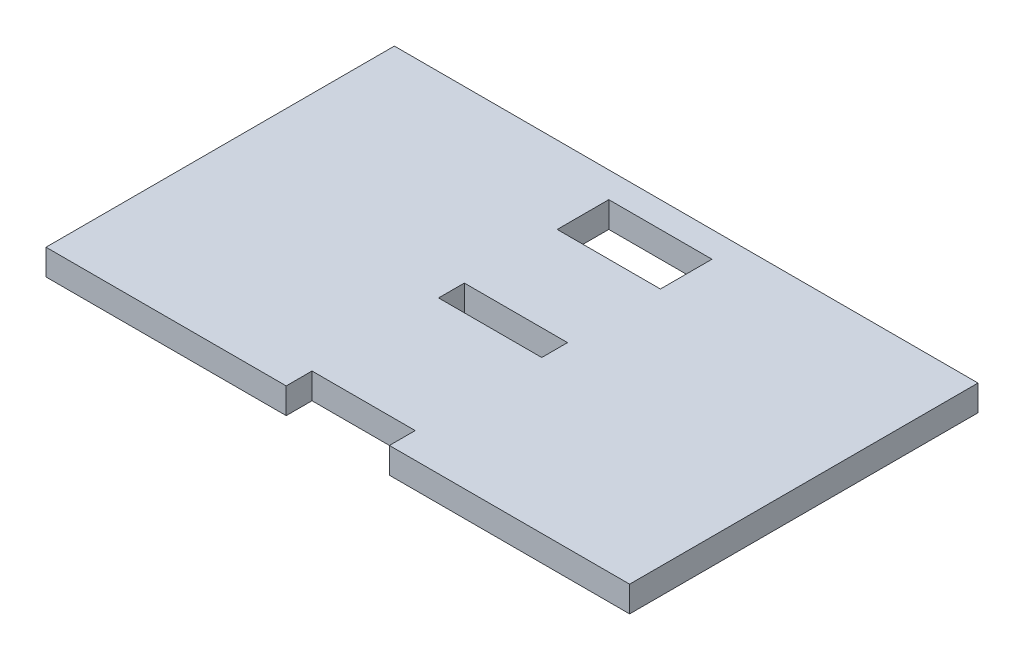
ISO-10303-21;
HEADER;
FILE_DESCRIPTION(('STEP AP214'),'2;1');
FILE_NAME('part.step','',(''),(''),'','','');
FILE_SCHEMA(('AUTOMOTIVE_DESIGN { 1 0 10303 214 1 1 1 1 }'));
ENDSEC;
DATA;
#1=APPLICATION_CONTEXT('core data for automotive mechanical design processes');
#2=APPLICATION_PROTOCOL_DEFINITION('international standard','automotive_design',2000,#1);
#3=PRODUCT_CONTEXT('',#1,'mechanical');
#4=PRODUCT('Part','Part','',(#3));
#5=PRODUCT_RELATED_PRODUCT_CATEGORY('part','',(#4));
#6=PRODUCT_DEFINITION_FORMATION('','',#4);
#7=PRODUCT_DEFINITION_CONTEXT('part definition',#1,'design');
#8=PRODUCT_DEFINITION('design','',#6,#7);
#9=PRODUCT_DEFINITION_SHAPE('','',#8);
#10=(LENGTH_UNIT() NAMED_UNIT(*) SI_UNIT(.MILLI.,.METRE.));
#11=(NAMED_UNIT(*) PLANE_ANGLE_UNIT() SI_UNIT($,.RADIAN.));
#12=(NAMED_UNIT(*) SI_UNIT($,.STERADIAN.) SOLID_ANGLE_UNIT());
#13=UNCERTAINTY_MEASURE_WITH_UNIT(LENGTH_MEASURE(1.E-05),#10,'distance_accuracy_value','');
#14=(GEOMETRIC_REPRESENTATION_CONTEXT(3) GLOBAL_UNCERTAINTY_ASSIGNED_CONTEXT((#13)) GLOBAL_UNIT_ASSIGNED_CONTEXT((#10,
#11,#12)) REPRESENTATION_CONTEXT('',''));
#15=CARTESIAN_POINT('',(0.,0.,0.));
#16=DIRECTION('',(0.,0.,1.));
#17=DIRECTION('',(1.,0.,0.));
#18=AXIS2_PLACEMENT_3D('',#15,#16,#17);
#19=CARTESIAN_POINT('',(0.,5.,0.));
#20=DIRECTION('',(0.,-1.,0.));
#21=DIRECTION('',(0.,0.,-1.));
#22=AXIS2_PLACEMENT_3D('',#19,#20,#21);
#23=PLANE('',#22);
#24=DIRECTION('',(0.,0.,1.));
#25=VECTOR('',#24,1.);
#26=CARTESIAN_POINT('',(46.55945,5.,-109.8613654));
#27=LINE('',#26,#25);
#28=CARTESIAN_POINT('',(46.55945,5.,-109.8613654));
#29=VERTEX_POINT('',#28);
#30=CARTESIAN_POINT('',(46.55945,5.,-99.8613654));
#31=VERTEX_POINT('',#30);
#32=EDGE_CURVE('E188',#29,#31,#27,.T.);
#33=ORIENTED_EDGE('',*,*,#32,.F.);
#34=DIRECTION('',(-1.,0.,0.));
#35=VECTOR('',#34,1.);
#36=CARTESIAN_POINT('',(46.55945,5.,-109.8613654));
#37=LINE('',#36,#35);
#38=CARTESIAN_POINT('',(66.55945,5.,-109.8613654));
#39=VERTEX_POINT('',#38);
#40=EDGE_CURVE('E196',#39,#29,#37,.T.);
#41=ORIENTED_EDGE('',*,*,#40,.F.);
#42=DIRECTION('',(0.,0.,-1.));
#43=VECTOR('',#42,1.);
#44=CARTESIAN_POINT('',(66.55945,5.,-109.8613654));
#45=LINE('',#44,#43);
#46=CARTESIAN_POINT('',(66.55945,5.,-99.8613654));
#47=VERTEX_POINT('',#46);
#48=EDGE_CURVE('E193',#47,#39,#45,.T.);
#49=ORIENTED_EDGE('',*,*,#48,.F.);
#50=DIRECTION('',(1.,0.,0.));
#51=VECTOR('',#50,1.);
#52=CARTESIAN_POINT('',(46.55945,5.,-99.8613654));
#53=LINE('',#52,#51);
#54=EDGE_CURVE('E190',#31,#47,#53,.T.);
#55=ORIENTED_EDGE('',*,*,#54,.F.);
#56=EDGE_LOOP('',(#33,#41,#49,#55));
#57=FACE_BOUND('',#56,.T.);
#58=DIRECTION('',(0.,0.,-1.));
#59=VECTOR('',#58,1.);
#60=CARTESIAN_POINT('',(113.1189,5.,-47.338));
#61=LINE('',#60,#59);
#62=CARTESIAN_POINT('',(113.1189,5.,-47.338));
#63=VERTEX_POINT('',#62);
#64=CARTESIAN_POINT('',(113.1189,5.,-114.8613654));
#65=VERTEX_POINT('',#64);
#66=EDGE_CURVE('E219',#63,#65,#61,.T.);
#67=ORIENTED_EDGE('',*,*,#66,.T.);
#68=DIRECTION('',(-1.,0.,0.));
#69=VECTOR('',#68,1.);
#70=CARTESIAN_POINT('',(0.,5.,-114.8613654));
#71=LINE('',#70,#69);
#72=CARTESIAN_POINT('',(0.,5.,-114.8613654));
#73=VERTEX_POINT('',#72);
#74=EDGE_CURVE('E222',#65,#73,#71,.T.);
#75=ORIENTED_EDGE('',*,*,#74,.T.);
#76=DIRECTION('',(0.,0.,1.));
#77=VECTOR('',#76,1.);
#78=CARTESIAN_POINT('',(0.,5.,-114.8613654));
#79=LINE('',#78,#77);
#80=CARTESIAN_POINT('',(0.,5.,-47.338));
#81=VERTEX_POINT('',#80);
#82=EDGE_CURVE('E225',#73,#81,#79,.T.);
#83=ORIENTED_EDGE('',*,*,#82,.T.);
#84=DIRECTION('',(1.,0.,0.));
#85=VECTOR('',#84,1.);
#86=CARTESIAN_POINT('',(0.,5.,-47.338));
#87=LINE('',#86,#85);
#88=CARTESIAN_POINT('',(46.55945,5.,-47.338));
#89=VERTEX_POINT('',#88);
#90=EDGE_CURVE('E227',#81,#89,#87,.T.);
#91=ORIENTED_EDGE('',*,*,#90,.T.);
#92=DIRECTION('',(0.,0.,-1.));
#93=VECTOR('',#92,1.);
#94=CARTESIAN_POINT('',(46.55945,5.,-47.338));
#95=LINE('',#94,#93);
#96=CARTESIAN_POINT('',(46.55945,5.,-52.338));
#97=VERTEX_POINT('',#96);
#98=EDGE_CURVE('E229',#89,#97,#95,.T.);
#99=ORIENTED_EDGE('',*,*,#98,.T.);
#100=DIRECTION('',(1.,0.,0.));
#101=VECTOR('',#100,1.);
#102=CARTESIAN_POINT('',(46.55945,5.,-52.338));
#103=LINE('',#102,#101);
#104=CARTESIAN_POINT('',(66.55945,5.,-52.338));
#105=VERTEX_POINT('',#104);
#106=EDGE_CURVE('E231',#97,#105,#103,.T.);
#107=ORIENTED_EDGE('',*,*,#106,.T.);
#108=DIRECTION('',(0.,0.,1.));
#109=VECTOR('',#108,1.);
#110=CARTESIAN_POINT('',(66.55945,5.,-47.338));
#111=LINE('',#110,#109);
#112=CARTESIAN_POINT('',(66.55945,5.,-47.338));
#113=VERTEX_POINT('',#112);
#114=EDGE_CURVE('E233',#105,#113,#111,.T.);
#115=ORIENTED_EDGE('',*,*,#114,.T.);
#116=DIRECTION('',(1.,0.,0.));
#117=VECTOR('',#116,1.);
#118=CARTESIAN_POINT('',(66.55945,5.,-47.338));
#119=LINE('',#118,#117);
#120=EDGE_CURVE('E235',#113,#63,#119,.T.);
#121=ORIENTED_EDGE('',*,*,#120,.T.);
#122=EDGE_LOOP('',(#67,#75,#83,#91,#99,#107,#115,#121));
#123=FACE_BOUND('',#122,.T.);
#124=DIRECTION('',(0.,0.,1.));
#125=VECTOR('',#124,1.);
#126=CARTESIAN_POINT('',(46.55945,5.,-76.86424));
#127=LINE('',#126,#125);
#128=CARTESIAN_POINT('',(46.55945,5.,-81.86424));
#129=VERTEX_POINT('',#128);
#130=CARTESIAN_POINT('',(46.55945,5.,-76.86424));
#131=VERTEX_POINT('',#130);
#132=EDGE_CURVE('E152',#129,#131,#127,.T.);
#133=ORIENTED_EDGE('',*,*,#132,.F.);
#134=DIRECTION('',(-1.,0.,0.));
#135=VECTOR('',#134,1.);
#136=CARTESIAN_POINT('',(46.55945,5.,-81.86424));
#137=LINE('',#136,#135);
#138=CARTESIAN_POINT('',(66.55945,5.,-81.86424));
#139=VERTEX_POINT('',#138);
#140=EDGE_CURVE('E174',#139,#129,#137,.T.);
#141=ORIENTED_EDGE('',*,*,#140,.F.);
#142=DIRECTION('',(0.,0.,-1.));
#143=VECTOR('',#142,1.);
#144=CARTESIAN_POINT('',(66.55945,5.,-76.86424));
#145=LINE('',#144,#143);
#146=CARTESIAN_POINT('',(66.55945,5.,-76.86424));
#147=VERTEX_POINT('',#146);
#148=EDGE_CURVE('E172',#147,#139,#145,.T.);
#149=ORIENTED_EDGE('',*,*,#148,.F.);
#150=DIRECTION('',(1.,0.,0.));
#151=VECTOR('',#150,1.);
#152=CARTESIAN_POINT('',(46.55945,5.,-76.86424));
#153=LINE('',#152,#151);
#154=EDGE_CURVE('E160',#131,#147,#153,.T.);
#155=ORIENTED_EDGE('',*,*,#154,.F.);
#156=EDGE_LOOP('',(#133,#141,#149,#155));
#157=FACE_BOUND('',#156,.T.);
#158=ADVANCED_FACE('F39',(#57,#123,#157),#23,.F.);
#159=CARTESIAN_POINT('',(0.,0.,0.));
#160=DIRECTION('',(0.,-1.,0.));
#161=DIRECTION('',(0.,0.,-1.));
#162=AXIS2_PLACEMENT_3D('',#159,#160,#161);
#163=PLANE('',#162);
#164=DIRECTION('',(0.,0.,-1.));
#165=VECTOR('',#164,1.);
#166=CARTESIAN_POINT('',(113.1189,0.,-47.338));
#167=LINE('',#166,#165);
#168=CARTESIAN_POINT('',(113.1189,0.,-47.338));
#169=VERTEX_POINT('',#168);
#170=CARTESIAN_POINT('',(113.1189,0.,-114.8613654));
#171=VERTEX_POINT('',#170);
#172=EDGE_CURVE('E218',#169,#171,#167,.T.);
#173=ORIENTED_EDGE('',*,*,#172,.F.);
#174=DIRECTION('',(1.,0.,0.));
#175=VECTOR('',#174,1.);
#176=CARTESIAN_POINT('',(66.55945,0.,-47.338));
#177=LINE('',#176,#175);
#178=CARTESIAN_POINT('',(66.55945,0.,-47.338));
#179=VERTEX_POINT('',#178);
#180=EDGE_CURVE('E223',#179,#169,#177,.T.);
#181=ORIENTED_EDGE('',*,*,#180,.F.);
#182=DIRECTION('',(0.,0.,1.));
#183=VECTOR('',#182,1.);
#184=CARTESIAN_POINT('',(66.55945,0.,-47.338));
#185=LINE('',#184,#183);
#186=CARTESIAN_POINT('',(66.55945,0.,-52.338));
#187=VERTEX_POINT('',#186);
#188=EDGE_CURVE('E250',#187,#179,#185,.T.);
#189=ORIENTED_EDGE('',*,*,#188,.F.);
#190=DIRECTION('',(1.,0.,0.));
#191=VECTOR('',#190,1.);
#192=CARTESIAN_POINT('',(46.55945,0.,-52.338));
#193=LINE('',#192,#191);
#194=CARTESIAN_POINT('',(46.55945,0.,-52.338));
#195=VERTEX_POINT('',#194);
#196=EDGE_CURVE('E248',#195,#187,#193,.T.);
#197=ORIENTED_EDGE('',*,*,#196,.F.);
#198=DIRECTION('',(0.,0.,-1.));
#199=VECTOR('',#198,1.);
#200=CARTESIAN_POINT('',(46.55945,0.,-47.338));
#201=LINE('',#200,#199);
#202=CARTESIAN_POINT('',(46.55945,0.,-47.338));
#203=VERTEX_POINT('',#202);
#204=EDGE_CURVE('E246',#203,#195,#201,.T.);
#205=ORIENTED_EDGE('',*,*,#204,.F.);
#206=DIRECTION('',(1.,0.,0.));
#207=VECTOR('',#206,1.);
#208=CARTESIAN_POINT('',(0.,0.,-47.338));
#209=LINE('',#208,#207);
#210=CARTESIAN_POINT('',(0.,0.,-47.338));
#211=VERTEX_POINT('',#210);
#212=EDGE_CURVE('E244',#211,#203,#209,.T.);
#213=ORIENTED_EDGE('',*,*,#212,.F.);
#214=DIRECTION('',(0.,0.,1.));
#215=VECTOR('',#214,1.);
#216=CARTESIAN_POINT('',(0.,0.,-114.8613654));
#217=LINE('',#216,#215);
#218=CARTESIAN_POINT('',(0.,0.,-114.8613654));
#219=VERTEX_POINT('',#218);
#220=EDGE_CURVE('E242',#219,#211,#217,.T.);
#221=ORIENTED_EDGE('',*,*,#220,.F.);
#222=DIRECTION('',(-1.,0.,0.));
#223=VECTOR('',#222,1.);
#224=CARTESIAN_POINT('',(0.,0.,-114.8613654));
#225=LINE('',#224,#223);
#226=EDGE_CURVE('E240',#171,#219,#225,.T.);
#227=ORIENTED_EDGE('',*,*,#226,.F.);
#228=EDGE_LOOP('',(#173,#181,#189,#197,#205,#213,#221,#227));
#229=FACE_BOUND('',#228,.T.);
#230=DIRECTION('',(-1.,0.,0.));
#231=VECTOR('',#230,1.);
#232=CARTESIAN_POINT('',(46.55945,0.,-109.8613654));
#233=LINE('',#232,#231);
#234=CARTESIAN_POINT('',(66.55945,0.,-109.8613654));
#235=VERTEX_POINT('',#234);
#236=CARTESIAN_POINT('',(46.55945,0.,-109.8613654));
#237=VERTEX_POINT('',#236);
#238=EDGE_CURVE('E191',#235,#237,#233,.T.);
#239=ORIENTED_EDGE('',*,*,#238,.T.);
#240=DIRECTION('',(0.,0.,1.));
#241=VECTOR('',#240,1.);
#242=CARTESIAN_POINT('',(46.55945,0.,-109.8613654));
#243=LINE('',#242,#241);
#244=CARTESIAN_POINT('',(46.55945,0.,-99.8613654));
#245=VERTEX_POINT('',#244);
#246=EDGE_CURVE('E168',#237,#245,#243,.T.);
#247=ORIENTED_EDGE('',*,*,#246,.T.);
#248=DIRECTION('',(1.,0.,0.));
#249=VECTOR('',#248,1.);
#250=CARTESIAN_POINT('',(46.55945,0.,-99.8613654));
#251=LINE('',#250,#249);
#252=CARTESIAN_POINT('',(66.55945,0.,-99.8613654));
#253=VERTEX_POINT('',#252);
#254=EDGE_CURVE('E201',#245,#253,#251,.T.);
#255=ORIENTED_EDGE('',*,*,#254,.T.);
#256=DIRECTION('',(0.,0.,-1.));
#257=VECTOR('',#256,1.);
#258=CARTESIAN_POINT('',(66.55945,0.,-109.8613654));
#259=LINE('',#258,#257);
#260=EDGE_CURVE('E204',#253,#235,#259,.T.);
#261=ORIENTED_EDGE('',*,*,#260,.T.);
#262=EDGE_LOOP('',(#239,#247,#255,#261));
#263=FACE_BOUND('',#262,.T.);
#264=DIRECTION('',(-1.,0.,0.));
#265=VECTOR('',#264,1.);
#266=CARTESIAN_POINT('',(46.55945,0.,-81.86424));
#267=LINE('',#266,#265);
#268=CARTESIAN_POINT('',(66.55945,0.,-81.86424));
#269=VERTEX_POINT('',#268);
#270=CARTESIAN_POINT('',(46.55945,0.,-81.86424));
#271=VERTEX_POINT('',#270);
#272=EDGE_CURVE('E161',#269,#271,#267,.T.);
#273=ORIENTED_EDGE('',*,*,#272,.T.);
#274=DIRECTION('',(0.,0.,1.));
#275=VECTOR('',#274,1.);
#276=CARTESIAN_POINT('',(46.55945,0.,-76.86424));
#277=LINE('',#276,#275);
#278=CARTESIAN_POINT('',(46.55945,0.,-76.86424));
#279=VERTEX_POINT('',#278);
#280=EDGE_CURVE('E62',#271,#279,#277,.T.);
#281=ORIENTED_EDGE('',*,*,#280,.T.);
#282=DIRECTION('',(1.,0.,0.));
#283=VECTOR('',#282,1.);
#284=CARTESIAN_POINT('',(46.55945,0.,-76.86424));
#285=LINE('',#284,#283);
#286=CARTESIAN_POINT('',(66.55945,0.,-76.86424));
#287=VERTEX_POINT('',#286);
#288=EDGE_CURVE('E167',#279,#287,#285,.T.);
#289=ORIENTED_EDGE('',*,*,#288,.T.);
#290=DIRECTION('',(0.,0.,-1.));
#291=VECTOR('',#290,1.);
#292=CARTESIAN_POINT('',(66.55945,0.,-76.86424));
#293=LINE('',#292,#291);
#294=EDGE_CURVE('E180',#287,#269,#293,.T.);
#295=ORIENTED_EDGE('',*,*,#294,.T.);
#296=EDGE_LOOP('',(#273,#281,#289,#295));
#297=FACE_BOUND('',#296,.T.);
#298=ADVANCED_FACE('F280',(#229,#263,#297),#163,.T.);
#299=CARTESIAN_POINT('',(113.1189,5.,-47.338));
#300=DIRECTION('',(-1.,0.,0.));
#301=DIRECTION('',(0.,0.,1.));
#302=AXIS2_PLACEMENT_3D('',#299,#300,#301);
#303=PLANE('',#302);
#304=ORIENTED_EDGE('',*,*,#172,.T.);
#305=DIRECTION('',(0.,-1.,0.));
#306=VECTOR('',#305,1.);
#307=CARTESIAN_POINT('',(113.1189,5.,-114.8613654));
#308=LINE('',#307,#306);
#309=EDGE_CURVE('E11',#65,#171,#308,.T.);
#310=ORIENTED_EDGE('',*,*,#309,.F.);
#311=ORIENTED_EDGE('',*,*,#66,.F.);
#312=DIRECTION('',(0.,-1.,0.));
#313=VECTOR('',#312,1.);
#314=CARTESIAN_POINT('',(113.1189,5.,-47.338));
#315=LINE('',#314,#313);
#316=EDGE_CURVE('E237',#63,#169,#315,.T.);
#317=ORIENTED_EDGE('',*,*,#316,.T.);
#318=EDGE_LOOP('',(#304,#310,#311,#317));
#319=FACE_BOUND('',#318,.T.);
#320=ADVANCED_FACE('F41',(#319),#303,.F.);
#321=CARTESIAN_POINT('',(0.,5.,-114.8613654));
#322=DIRECTION('',(0.,0.,1.));
#323=DIRECTION('',(1.,0.,0.));
#324=AXIS2_PLACEMENT_3D('',#321,#322,#323);
#325=PLANE('',#324);
#326=ORIENTED_EDGE('',*,*,#226,.T.);
#327=DIRECTION('',(0.,-1.,0.));
#328=VECTOR('',#327,1.);
#329=CARTESIAN_POINT('',(0.,5.,-114.8613654));
#330=LINE('',#329,#328);
#331=EDGE_CURVE('E47',#73,#219,#330,.T.);
#332=ORIENTED_EDGE('',*,*,#331,.F.);
#333=ORIENTED_EDGE('',*,*,#74,.F.);
#334=ORIENTED_EDGE('',*,*,#309,.T.);
#335=EDGE_LOOP('',(#326,#332,#333,#334));
#336=FACE_BOUND('',#335,.T.);
#337=ADVANCED_FACE('F297',(#336),#325,.F.);
#338=CARTESIAN_POINT('',(0.,5.,-114.8613654));
#339=DIRECTION('',(1.,0.,0.));
#340=DIRECTION('',(0.,0.,-1.));
#341=AXIS2_PLACEMENT_3D('',#338,#339,#340);
#342=PLANE('',#341);
#343=ORIENTED_EDGE('',*,*,#220,.T.);
#344=DIRECTION('',(0.,-1.,0.));
#345=VECTOR('',#344,1.);
#346=CARTESIAN_POINT('',(0.,5.,-47.338));
#347=LINE('',#346,#345);
#348=EDGE_CURVE('E267',#81,#211,#347,.T.);
#349=ORIENTED_EDGE('',*,*,#348,.F.);
#350=ORIENTED_EDGE('',*,*,#82,.F.);
#351=ORIENTED_EDGE('',*,*,#331,.T.);
#352=EDGE_LOOP('',(#343,#349,#350,#351));
#353=FACE_BOUND('',#352,.T.);
#354=ADVANCED_FACE('F274',(#353),#342,.F.);
#355=CARTESIAN_POINT('',(0.,5.,-47.338));
#356=DIRECTION('',(0.,0.,-1.));
#357=DIRECTION('',(-1.,0.,0.));
#358=AXIS2_PLACEMENT_3D('',#355,#356,#357);
#359=PLANE('',#358);
#360=ORIENTED_EDGE('',*,*,#212,.T.);
#361=DIRECTION('',(0.,-1.,0.));
#362=VECTOR('',#361,1.);
#363=CARTESIAN_POINT('',(46.55945,5.,-47.338));
#364=LINE('',#363,#362);
#365=EDGE_CURVE('E264',#89,#203,#364,.T.);
#366=ORIENTED_EDGE('',*,*,#365,.F.);
#367=ORIENTED_EDGE('',*,*,#90,.F.);
#368=ORIENTED_EDGE('',*,*,#348,.T.);
#369=EDGE_LOOP('',(#360,#366,#367,#368));
#370=FACE_BOUND('',#369,.T.);
#371=ADVANCED_FACE('F286',(#370),#359,.F.);
#372=CARTESIAN_POINT('',(46.55945,5.,-47.338));
#373=DIRECTION('',(-1.,0.,0.));
#374=DIRECTION('',(0.,0.,1.));
#375=AXIS2_PLACEMENT_3D('',#372,#373,#374);
#376=PLANE('',#375);
#377=ORIENTED_EDGE('',*,*,#204,.T.);
#378=DIRECTION('',(0.,-1.,0.));
#379=VECTOR('',#378,1.);
#380=CARTESIAN_POINT('',(46.55945,5.,-52.338));
#381=LINE('',#380,#379);
#382=EDGE_CURVE('E261',#97,#195,#381,.T.);
#383=ORIENTED_EDGE('',*,*,#382,.F.);
#384=ORIENTED_EDGE('',*,*,#98,.F.);
#385=ORIENTED_EDGE('',*,*,#365,.T.);
#386=EDGE_LOOP('',(#377,#383,#384,#385));
#387=FACE_BOUND('',#386,.T.);
#388=ADVANCED_FACE('F290',(#387),#376,.F.);
#389=CARTESIAN_POINT('',(46.55945,5.,-52.338));
#390=DIRECTION('',(0.,0.,-1.));
#391=DIRECTION('',(-1.,0.,0.));
#392=AXIS2_PLACEMENT_3D('',#389,#390,#391);
#393=PLANE('',#392);
#394=ORIENTED_EDGE('',*,*,#196,.T.);
#395=DIRECTION('',(0.,-1.,0.));
#396=VECTOR('',#395,1.);
#397=CARTESIAN_POINT('',(66.55945,5.,-52.338));
#398=LINE('',#397,#396);
#399=EDGE_CURVE('E258',#105,#187,#398,.T.);
#400=ORIENTED_EDGE('',*,*,#399,.F.);
#401=ORIENTED_EDGE('',*,*,#106,.F.);
#402=ORIENTED_EDGE('',*,*,#382,.T.);
#403=EDGE_LOOP('',(#394,#400,#401,#402));
#404=FACE_BOUND('',#403,.T.);
#405=ADVANCED_FACE('F310',(#404),#393,.F.);
#406=CARTESIAN_POINT('',(66.55945,5.,-47.338));
#407=DIRECTION('',(1.,0.,0.));
#408=DIRECTION('',(0.,0.,-1.));
#409=AXIS2_PLACEMENT_3D('',#406,#407,#408);
#410=PLANE('',#409);
#411=ORIENTED_EDGE('',*,*,#188,.T.);
#412=DIRECTION('',(0.,-1.,0.));
#413=VECTOR('',#412,1.);
#414=CARTESIAN_POINT('',(66.55945,5.,-47.338));
#415=LINE('',#414,#413);
#416=EDGE_CURVE('E255',#113,#179,#415,.T.);
#417=ORIENTED_EDGE('',*,*,#416,.F.);
#418=ORIENTED_EDGE('',*,*,#114,.F.);
#419=ORIENTED_EDGE('',*,*,#399,.T.);
#420=EDGE_LOOP('',(#411,#417,#418,#419));
#421=FACE_BOUND('',#420,.T.);
#422=ADVANCED_FACE('F308',(#421),#410,.F.);
#423=CARTESIAN_POINT('',(66.55945,5.,-47.338));
#424=DIRECTION('',(0.,0.,-1.));
#425=DIRECTION('',(-1.,0.,0.));
#426=AXIS2_PLACEMENT_3D('',#423,#424,#425);
#427=PLANE('',#426);
#428=ORIENTED_EDGE('',*,*,#180,.T.);
#429=ORIENTED_EDGE('',*,*,#316,.F.);
#430=ORIENTED_EDGE('',*,*,#120,.F.);
#431=ORIENTED_EDGE('',*,*,#416,.T.);
#432=EDGE_LOOP('',(#428,#429,#430,#431));
#433=FACE_BOUND('',#432,.T.);
#434=ADVANCED_FACE('F303',(#433),#427,.F.);
#435=CARTESIAN_POINT('',(46.55945,5.,-109.8613654));
#436=DIRECTION('',(1.,0.,0.));
#437=DIRECTION('',(0.,0.,-1.));
#438=AXIS2_PLACEMENT_3D('',#435,#436,#437);
#439=PLANE('',#438);
#440=ORIENTED_EDGE('',*,*,#246,.F.);
#441=DIRECTION('',(0.,-1.,0.));
#442=VECTOR('',#441,1.);
#443=CARTESIAN_POINT('',(46.55945,5.,-109.8613654));
#444=LINE('',#443,#442);
#445=EDGE_CURVE('E198',#29,#237,#444,.T.);
#446=ORIENTED_EDGE('',*,*,#445,.F.);
#447=ORIENTED_EDGE('',*,*,#32,.T.);
#448=DIRECTION('',(0.,-1.,0.));
#449=VECTOR('',#448,1.);
#450=CARTESIAN_POINT('',(46.55945,5.,-99.8613654));
#451=LINE('',#450,#449);
#452=EDGE_CURVE('E215',#31,#245,#451,.T.);
#453=ORIENTED_EDGE('',*,*,#452,.T.);
#454=EDGE_LOOP('',(#440,#446,#447,#453));
#455=FACE_BOUND('',#454,.T.);
#456=ADVANCED_FACE('F328',(#455),#439,.T.);
#457=CARTESIAN_POINT('',(46.55945,5.,-99.8613654));
#458=DIRECTION('',(0.,0.,-1.));
#459=DIRECTION('',(-1.,0.,0.));
#460=AXIS2_PLACEMENT_3D('',#457,#458,#459);
#461=PLANE('',#460);
#462=ORIENTED_EDGE('',*,*,#254,.F.);
#463=ORIENTED_EDGE('',*,*,#452,.F.);
#464=ORIENTED_EDGE('',*,*,#54,.T.);
#465=DIRECTION('',(0.,-1.,0.));
#466=VECTOR('',#465,1.);
#467=CARTESIAN_POINT('',(66.55945,5.,-99.8613654));
#468=LINE('',#467,#466);
#469=EDGE_CURVE('E213',#47,#253,#468,.T.);
#470=ORIENTED_EDGE('',*,*,#469,.T.);
#471=EDGE_LOOP('',(#462,#463,#464,#470));
#472=FACE_BOUND('',#471,.T.);
#473=ADVANCED_FACE('F335',(#472),#461,.T.);
#474=CARTESIAN_POINT('',(66.55945,5.,-109.8613654));
#475=DIRECTION('',(-1.,0.,0.));
#476=DIRECTION('',(0.,0.,1.));
#477=AXIS2_PLACEMENT_3D('',#474,#475,#476);
#478=PLANE('',#477);
#479=ORIENTED_EDGE('',*,*,#260,.F.);
#480=ORIENTED_EDGE('',*,*,#469,.F.);
#481=ORIENTED_EDGE('',*,*,#48,.T.);
#482=DIRECTION('',(0.,-1.,0.));
#483=VECTOR('',#482,1.);
#484=CARTESIAN_POINT('',(66.55945,5.,-109.8613654));
#485=LINE('',#484,#483);
#486=EDGE_CURVE('E211',#39,#235,#485,.T.);
#487=ORIENTED_EDGE('',*,*,#486,.T.);
#488=EDGE_LOOP('',(#479,#480,#481,#487));
#489=FACE_BOUND('',#488,.T.);
#490=ADVANCED_FACE('F340',(#489),#478,.T.);
#491=CARTESIAN_POINT('',(46.55945,5.,-109.8613654));
#492=DIRECTION('',(0.,0.,1.));
#493=DIRECTION('',(1.,0.,0.));
#494=AXIS2_PLACEMENT_3D('',#491,#492,#493);
#495=PLANE('',#494);
#496=ORIENTED_EDGE('',*,*,#238,.F.);
#497=ORIENTED_EDGE('',*,*,#486,.F.);
#498=ORIENTED_EDGE('',*,*,#40,.T.);
#499=ORIENTED_EDGE('',*,*,#445,.T.);
#500=EDGE_LOOP('',(#496,#497,#498,#499));
#501=FACE_BOUND('',#500,.T.);
#502=ADVANCED_FACE('F346',(#501),#495,.T.);
#503=CARTESIAN_POINT('',(46.55945,5.,-76.86424));
#504=DIRECTION('',(1.,0.,0.));
#505=DIRECTION('',(0.,0.,-1.));
#506=AXIS2_PLACEMENT_3D('',#503,#504,#505);
#507=PLANE('',#506);
#508=ORIENTED_EDGE('',*,*,#280,.F.);
#509=DIRECTION('',(0.,-1.,0.));
#510=VECTOR('',#509,1.);
#511=CARTESIAN_POINT('',(46.55945,5.,-81.86424));
#512=LINE('',#511,#510);
#513=EDGE_CURVE('E156',#129,#271,#512,.T.);
#514=ORIENTED_EDGE('',*,*,#513,.F.);
#515=ORIENTED_EDGE('',*,*,#132,.T.);
#516=DIRECTION('',(0.,-1.,0.));
#517=VECTOR('',#516,1.);
#518=CARTESIAN_POINT('',(46.55945,5.,-76.86424));
#519=LINE('',#518,#517);
#520=EDGE_CURVE('E155',#131,#279,#519,.T.);
#521=ORIENTED_EDGE('',*,*,#520,.T.);
#522=EDGE_LOOP('',(#508,#514,#515,#521));
#523=FACE_BOUND('',#522,.T.);
#524=ADVANCED_FACE('F154',(#523),#507,.T.);
#525=CARTESIAN_POINT('',(46.55945,5.,-76.86424));
#526=DIRECTION('',(0.,0.,-1.));
#527=DIRECTION('',(-1.,0.,0.));
#528=AXIS2_PLACEMENT_3D('',#525,#526,#527);
#529=PLANE('',#528);
#530=ORIENTED_EDGE('',*,*,#288,.F.);
#531=ORIENTED_EDGE('',*,*,#520,.F.);
#532=ORIENTED_EDGE('',*,*,#154,.T.);
#533=DIRECTION('',(0.,-1.,0.));
#534=VECTOR('',#533,1.);
#535=CARTESIAN_POINT('',(66.55945,5.,-76.86424));
#536=LINE('',#535,#534);
#537=EDGE_CURVE('E169',#147,#287,#536,.T.);
#538=ORIENTED_EDGE('',*,*,#537,.T.);
#539=EDGE_LOOP('',(#530,#531,#532,#538));
#540=FACE_BOUND('',#539,.T.);
#541=ADVANCED_FACE('F164',(#540),#529,.T.);
#542=CARTESIAN_POINT('',(66.55945,5.,-76.86424));
#543=DIRECTION('',(-1.,0.,0.));
#544=DIRECTION('',(0.,0.,1.));
#545=AXIS2_PLACEMENT_3D('',#542,#543,#544);
#546=PLANE('',#545);
#547=ORIENTED_EDGE('',*,*,#294,.F.);
#548=ORIENTED_EDGE('',*,*,#537,.F.);
#549=ORIENTED_EDGE('',*,*,#148,.T.);
#550=DIRECTION('',(0.,-1.,0.));
#551=VECTOR('',#550,1.);
#552=CARTESIAN_POINT('',(66.55945,5.,-81.86424));
#553=LINE('',#552,#551);
#554=EDGE_CURVE('E54',#139,#269,#553,.T.);
#555=ORIENTED_EDGE('',*,*,#554,.T.);
#556=EDGE_LOOP('',(#547,#548,#549,#555));
#557=FACE_BOUND('',#556,.T.);
#558=ADVANCED_FACE('F365',(#557),#546,.T.);
#559=CARTESIAN_POINT('',(46.55945,5.,-81.86424));
#560=DIRECTION('',(0.,0.,1.));
#561=DIRECTION('',(1.,0.,0.));
#562=AXIS2_PLACEMENT_3D('',#559,#560,#561);
#563=PLANE('',#562);
#564=ORIENTED_EDGE('',*,*,#272,.F.);
#565=ORIENTED_EDGE('',*,*,#554,.F.);
#566=ORIENTED_EDGE('',*,*,#140,.T.);
#567=ORIENTED_EDGE('',*,*,#513,.T.);
#568=EDGE_LOOP('',(#564,#565,#566,#567));
#569=FACE_BOUND('',#568,.T.);
#570=ADVANCED_FACE('F368',(#569),#563,.T.);
#571=CLOSED_SHELL('',(#158,#298,#320,#337,#354,#371,#388,#405,#422,#434,#456,#473,#490,#502,
#524,#541,#558,#570));
#572=MANIFOLD_SOLID_BREP('B2',#571);
#573=ADVANCED_BREP_SHAPE_REPRESENTATION('',(#18,#572),#14);
#574=SHAPE_DEFINITION_REPRESENTATION(#9,#573);
ENDSEC;
END-ISO-10303-21;
